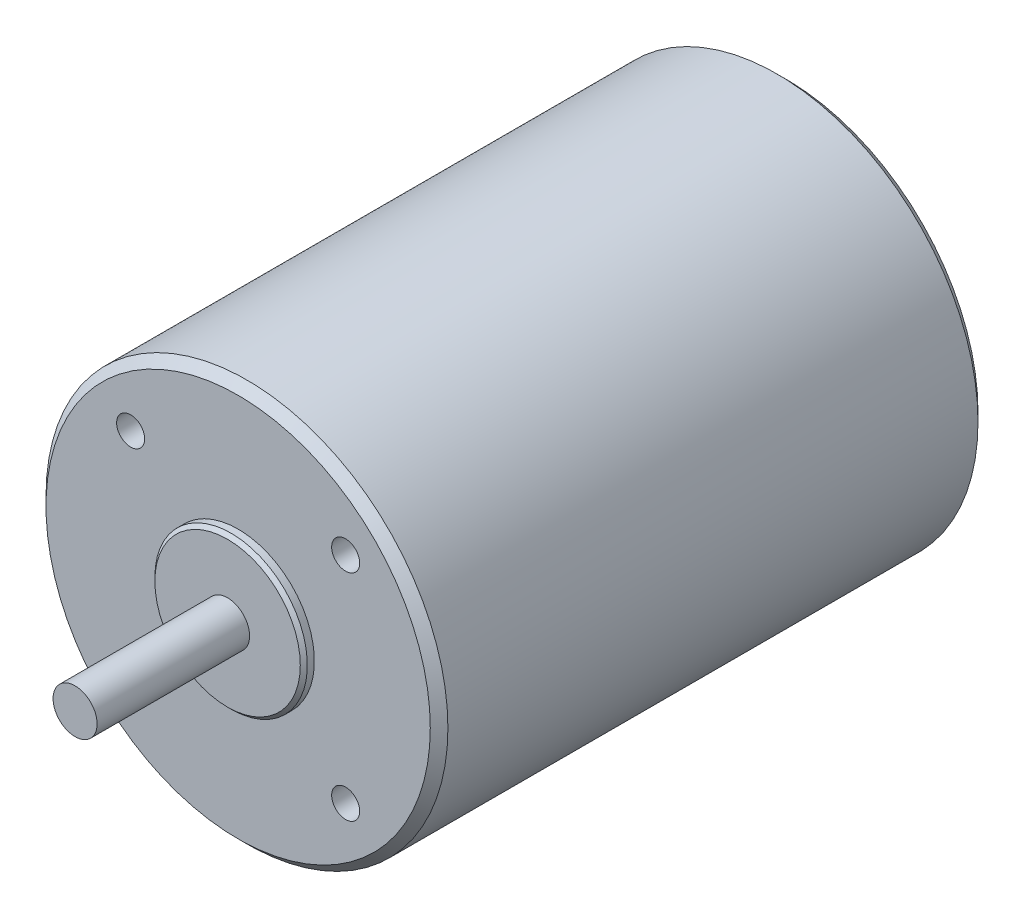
ISO-10303-21;
HEADER;
FILE_DESCRIPTION(('STEP AP214'),'2;1');
FILE_NAME('part.step','',(''),(''),'','','');
FILE_SCHEMA(('AUTOMOTIVE_DESIGN { 1 0 10303 214 1 1 1 1 }'));
ENDSEC;
DATA;
#1=APPLICATION_CONTEXT('core data for automotive mechanical design processes');
#2=APPLICATION_PROTOCOL_DEFINITION('international standard','automotive_design',2000,#1);
#3=PRODUCT_CONTEXT('',#1,'mechanical');
#4=PRODUCT('Part','Part','',(#3));
#5=PRODUCT_RELATED_PRODUCT_CATEGORY('part','',(#4));
#6=PRODUCT_DEFINITION_FORMATION('','',#4);
#7=PRODUCT_DEFINITION_CONTEXT('part definition',#1,'design');
#8=PRODUCT_DEFINITION('design','',#6,#7);
#9=PRODUCT_DEFINITION_SHAPE('','',#8);
#10=(LENGTH_UNIT() NAMED_UNIT(*) SI_UNIT(.MILLI.,.METRE.));
#11=(NAMED_UNIT(*) PLANE_ANGLE_UNIT() SI_UNIT($,.RADIAN.));
#12=(NAMED_UNIT(*) SI_UNIT($,.STERADIAN.) SOLID_ANGLE_UNIT());
#13=UNCERTAINTY_MEASURE_WITH_UNIT(LENGTH_MEASURE(1.E-05),#10,'distance_accuracy_value','');
#14=(GEOMETRIC_REPRESENTATION_CONTEXT(3) GLOBAL_UNCERTAINTY_ASSIGNED_CONTEXT((#13)) GLOBAL_UNIT_ASSIGNED_CONTEXT((#10,
#11,#12)) REPRESENTATION_CONTEXT('',''));
#15=CARTESIAN_POINT('',(0.,0.,0.));
#16=DIRECTION('',(0.,0.,1.));
#17=DIRECTION('',(1.,0.,0.));
#18=AXIS2_PLACEMENT_3D('',#15,#16,#17);
#19=CARTESIAN_POINT('',(0.,0.,78.9178));
#20=DIRECTION('',(0.,0.,1.));
#21=DIRECTION('',(1.,0.,0.));
#22=AXIS2_PLACEMENT_3D('',#19,#20,#21);
#23=PLANE('',#22);
#24=CARTESIAN_POINT('',(15.4909418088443,15.4909418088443,78.9178));
#25=DIRECTION('',(0.,0.,1.));
#26=DIRECTION('',(1.,0.,0.));
#27=AXIS2_PLACEMENT_3D('',#24,#25,#26);
#28=CIRCLE('',#27,2.0193);
#29=CARTESIAN_POINT('',(17.5102418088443,15.4909418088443,78.9178));
#30=VERTEX_POINT('',#29);
#31=EDGE_CURVE('E72',#30,#30,#28,.T.);
#32=ORIENTED_EDGE('',*,*,#31,.F.);
#33=EDGE_LOOP('',(#32));
#34=FACE_BOUND('',#33,.T.);
#35=CARTESIAN_POINT('',(15.4909418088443,-15.4909418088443,78.9178));
#36=DIRECTION('',(0.,0.,1.));
#37=DIRECTION('',(1.,0.,0.));
#38=AXIS2_PLACEMENT_3D('',#35,#36,#37);
#39=CIRCLE('',#38,2.0193);
#40=CARTESIAN_POINT('',(17.5102418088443,-15.4909418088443,78.9178));
#41=VERTEX_POINT('',#40);
#42=EDGE_CURVE('E80',#41,#41,#39,.T.);
#43=ORIENTED_EDGE('',*,*,#42,.F.);
#44=EDGE_LOOP('',(#43));
#45=FACE_BOUND('',#44,.T.);
#46=CARTESIAN_POINT('',(-15.4909418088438,-15.4909418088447,78.9178));
#47=DIRECTION('',(0.,0.,1.));
#48=DIRECTION('',(1.,0.,0.));
#49=AXIS2_PLACEMENT_3D('',#46,#47,#48);
#50=CIRCLE('',#49,2.0193);
#51=CARTESIAN_POINT('',(-13.4716418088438,-15.4909418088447,78.9178));
#52=VERTEX_POINT('',#51);
#53=EDGE_CURVE('E86',#52,#52,#50,.T.);
#54=ORIENTED_EDGE('',*,*,#53,.F.);
#55=EDGE_LOOP('',(#54));
#56=FACE_BOUND('',#55,.T.);
#57=CARTESIAN_POINT('',(-15.4909418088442,15.4909418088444,78.9178));
#58=DIRECTION('',(0.,0.,1.));
#59=DIRECTION('',(1.,0.,0.));
#60=AXIS2_PLACEMENT_3D('',#57,#58,#59);
#61=CIRCLE('',#60,2.0193);
#62=CARTESIAN_POINT('',(-13.4716418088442,15.4909418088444,78.9178));
#63=VERTEX_POINT('',#62);
#64=EDGE_CURVE('E92',#63,#63,#61,.T.);
#65=ORIENTED_EDGE('',*,*,#64,.F.);
#66=EDGE_LOOP('',(#65));
#67=FACE_BOUND('',#66,.T.);
#68=CARTESIAN_POINT('',(0.,0.,78.9178));
#69=DIRECTION('',(0.,0.,1.));
#70=DIRECTION('',(1.,0.,0.));
#71=AXIS2_PLACEMENT_3D('',#68,#69,#70);
#72=CIRCLE('',#71,27.686);
#73=CARTESIAN_POINT('',(27.686,0.,78.9178));
#74=VERTEX_POINT('',#73);
#75=EDGE_CURVE('E11',#74,#74,#72,.T.);
#76=ORIENTED_EDGE('',*,*,#75,.T.);
#77=EDGE_LOOP('',(#76));
#78=FACE_BOUND('',#77,.T.);
#79=CARTESIAN_POINT('',(0.,0.,78.9178));
#80=DIRECTION('',(0.,0.,1.));
#81=DIRECTION('',(1.,0.,0.));
#82=AXIS2_PLACEMENT_3D('',#79,#80,#81);
#83=CIRCLE('',#82,10.9855);
#84=CARTESIAN_POINT('',(-10.9855,0.,78.9178));
#85=VERTEX_POINT('',#84);
#86=EDGE_CURVE('E95',#85,#85,#83,.T.);
#87=ORIENTED_EDGE('',*,*,#86,.F.);
#88=EDGE_LOOP('',(#87));
#89=FACE_BOUND('',#88,.T.);
#90=ADVANCED_FACE('F42',(#34,#45,#56,#67,#78,#89),#23,.T.);
#91=CARTESIAN_POINT('',(0.,0.,78.9178));
#92=DIRECTION('',(0.,0.,-1.));
#93=DIRECTION('',(-1.,0.,0.));
#94=AXIS2_PLACEMENT_3D('',#91,#92,#93);
#95=CYLINDRICAL_SURFACE('',#94,28.956);
#96=CARTESIAN_POINT('',(0.,0.,1.27000000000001));
#97=DIRECTION('',(0.,0.,1.));
#98=DIRECTION('',(1.,0.,0.));
#99=AXIS2_PLACEMENT_3D('',#96,#97,#98);
#100=CIRCLE('',#99,28.956);
#101=CARTESIAN_POINT('',(28.956,0.,1.27000000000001));
#102=VERTEX_POINT('',#101);
#103=EDGE_CURVE('E113',#102,#102,#100,.T.);
#104=ORIENTED_EDGE('',*,*,#103,.T.);
#105=EDGE_LOOP('',(#104));
#106=FACE_BOUND('',#105,.T.);
#107=CARTESIAN_POINT('',(0.,0.,77.6478));
#108=DIRECTION('',(0.,0.,1.));
#109=DIRECTION('',(1.,0.,0.));
#110=AXIS2_PLACEMENT_3D('',#107,#108,#109);
#111=CIRCLE('',#110,28.956);
#112=CARTESIAN_POINT('',(28.956,0.,77.6478));
#113=VERTEX_POINT('',#112);
#114=EDGE_CURVE('E110',#113,#113,#111,.F.);
#115=ORIENTED_EDGE('',*,*,#114,.T.);
#116=EDGE_LOOP('',(#115));
#117=FACE_BOUND('',#116,.T.);
#118=ADVANCED_FACE('F44',(#106,#117),#95,.T.);
#119=CARTESIAN_POINT('',(0.,0.,0.));
#120=DIRECTION('',(0.,0.,1.));
#121=DIRECTION('',(1.,0.,0.));
#122=AXIS2_PLACEMENT_3D('',#119,#120,#121);
#123=PLANE('',#122);
#124=CARTESIAN_POINT('',(0.,0.,0.));
#125=DIRECTION('',(0.,0.,1.));
#126=DIRECTION('',(1.,0.,0.));
#127=AXIS2_PLACEMENT_3D('',#124,#125,#126);
#128=CIRCLE('',#127,27.686);
#129=CARTESIAN_POINT('',(27.686,0.,0.));
#130=VERTEX_POINT('',#129);
#131=EDGE_CURVE('E50',#130,#130,#128,.F.);
#132=ORIENTED_EDGE('',*,*,#131,.T.);
#133=EDGE_LOOP('',(#132));
#134=FACE_BOUND('',#133,.T.);
#135=ADVANCED_FACE('F118',(#134),#123,.F.);
#136=CARTESIAN_POINT('',(0.,0.,80.4418));
#137=DIRECTION('',(0.,0.,1.));
#138=DIRECTION('',(1.,0.,0.));
#139=AXIS2_PLACEMENT_3D('',#136,#137,#138);
#140=PLANE('',#139);
#141=CARTESIAN_POINT('',(0.,0.,80.4418));
#142=DIRECTION('',(0.,0.,1.));
#143=DIRECTION('',(1.,0.,0.));
#144=AXIS2_PLACEMENT_3D('',#141,#142,#143);
#145=CIRCLE('',#144,10.4775);
#146=CARTESIAN_POINT('',(10.4775,0.,80.4418));
#147=VERTEX_POINT('',#146);
#148=EDGE_CURVE('E102',#147,#147,#145,.T.);
#149=ORIENTED_EDGE('',*,*,#148,.T.);
#150=EDGE_LOOP('',(#149));
#151=FACE_BOUND('',#150,.T.);
#152=CARTESIAN_POINT('',(0.,0.,80.4418));
#153=DIRECTION('',(0.,0.,1.));
#154=DIRECTION('',(1.,0.,0.));
#155=AXIS2_PLACEMENT_3D('',#152,#153,#154);
#156=CIRCLE('',#155,3.175);
#157=CARTESIAN_POINT('',(3.175,0.,80.4418));
#158=VERTEX_POINT('',#157);
#159=EDGE_CURVE('E98',#158,#158,#156,.T.);
#160=ORIENTED_EDGE('',*,*,#159,.F.);
#161=EDGE_LOOP('',(#160));
#162=FACE_BOUND('',#161,.T.);
#163=ADVANCED_FACE('F146',(#151,#162),#140,.T.);
#164=CARTESIAN_POINT('',(0.,0.,80.4418));
#165=DIRECTION('',(0.,0.,-1.));
#166=DIRECTION('',(-1.,0.,0.));
#167=AXIS2_PLACEMENT_3D('',#164,#165,#166);
#168=CYLINDRICAL_SURFACE('',#167,10.9855);
#169=CARTESIAN_POINT('',(0.,0.,79.9338));
#170=DIRECTION('',(0.,0.,1.));
#171=DIRECTION('',(1.,0.,0.));
#172=AXIS2_PLACEMENT_3D('',#169,#170,#171);
#173=CIRCLE('',#172,10.9855);
#174=CARTESIAN_POINT('',(-10.9855,0.,79.9338));
#175=VERTEX_POINT('',#174);
#176=EDGE_CURVE('E107',#175,#175,#173,.F.);
#177=CARTESIAN_POINT('',(-10.9855,0.,79.9338));
#178=CARTESIAN_POINT('',(-10.9855,0.,79.9232166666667));
#179=CARTESIAN_POINT('',(-10.9855,0.,79.9126333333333));
#180=CARTESIAN_POINT('',(-10.9855,0.,79.8914666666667));
#181=CARTESIAN_POINT('',(-10.9855,0.,79.8808833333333));
#182=CARTESIAN_POINT('',(-10.9855,0.,79.8597166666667));
#183=CARTESIAN_POINT('',(-10.9855,0.,79.8491333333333));
#184=CARTESIAN_POINT('',(-10.9855,0.,79.8279666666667));
#185=CARTESIAN_POINT('',(-10.9855,0.,79.8173833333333));
#186=CARTESIAN_POINT('',(-10.9855,0.,79.7962166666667));
#187=CARTESIAN_POINT('',(-10.9855,0.,79.7856333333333));
#188=CARTESIAN_POINT('',(-10.9855,0.,79.7644666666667));
#189=CARTESIAN_POINT('',(-10.9855,0.,79.7538833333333));
#190=CARTESIAN_POINT('',(-10.9855,0.,79.7327166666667));
#191=CARTESIAN_POINT('',(-10.9855,0.,79.7221333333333));
#192=CARTESIAN_POINT('',(-10.9855,0.,79.7009666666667));
#193=CARTESIAN_POINT('',(-10.9855,0.,79.6903833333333));
#194=CARTESIAN_POINT('',(-10.9855,0.,79.6692166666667));
#195=CARTESIAN_POINT('',(-10.9855,0.,79.6586333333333));
#196=CARTESIAN_POINT('',(-10.9855,0.,79.6374666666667));
#197=CARTESIAN_POINT('',(-10.9855,0.,79.6268833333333));
#198=CARTESIAN_POINT('',(-10.9855,0.,79.6057166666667));
#199=CARTESIAN_POINT('',(-10.9855,0.,79.5951333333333));
#200=CARTESIAN_POINT('',(-10.9855,0.,79.5739666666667));
#201=CARTESIAN_POINT('',(-10.9855,0.,79.5633833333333));
#202=CARTESIAN_POINT('',(-10.9855,0.,79.5422166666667));
#203=CARTESIAN_POINT('',(-10.9855,0.,79.5316333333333));
#204=CARTESIAN_POINT('',(-10.9855,0.,79.5104666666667));
#205=CARTESIAN_POINT('',(-10.9855,0.,79.4998833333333));
#206=CARTESIAN_POINT('',(-10.9855,0.,79.4787166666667));
#207=CARTESIAN_POINT('',(-10.9855,0.,79.4681333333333));
#208=CARTESIAN_POINT('',(-10.9855,0.,79.4469666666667));
#209=CARTESIAN_POINT('',(-10.9855,0.,79.4363833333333));
#210=CARTESIAN_POINT('',(-10.9855,0.,79.4152166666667));
#211=CARTESIAN_POINT('',(-10.9855,0.,79.4046333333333));
#212=CARTESIAN_POINT('',(-10.9855,0.,79.3834666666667));
#213=CARTESIAN_POINT('',(-10.9855,0.,79.3728833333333));
#214=CARTESIAN_POINT('',(-10.9855,0.,79.3517166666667));
#215=CARTESIAN_POINT('',(-10.9855,0.,79.3411333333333));
#216=CARTESIAN_POINT('',(-10.9855,0.,79.3199666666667));
#217=CARTESIAN_POINT('',(-10.9855,0.,79.3093833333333));
#218=CARTESIAN_POINT('',(-10.9855,0.,79.2882166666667));
#219=CARTESIAN_POINT('',(-10.9855,0.,79.2776333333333));
#220=CARTESIAN_POINT('',(-10.9855,0.,79.2564666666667));
#221=CARTESIAN_POINT('',(-10.9855,0.,79.2458833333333));
#222=CARTESIAN_POINT('',(-10.9855,0.,79.2247166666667));
#223=CARTESIAN_POINT('',(-10.9855,0.,79.2141333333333));
#224=CARTESIAN_POINT('',(-10.9855,0.,79.1929666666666));
#225=CARTESIAN_POINT('',(-10.9855,0.,79.1823833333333));
#226=CARTESIAN_POINT('',(-10.9855,0.,79.1612166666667));
#227=CARTESIAN_POINT('',(-10.9855,0.,79.1506333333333));
#228=CARTESIAN_POINT('',(-10.9855,0.,79.1294666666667));
#229=CARTESIAN_POINT('',(-10.9855,0.,79.1188833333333));
#230=CARTESIAN_POINT('',(-10.9855,0.,79.0977166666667));
#231=CARTESIAN_POINT('',(-10.9855,0.,79.0871333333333));
#232=CARTESIAN_POINT('',(-10.9855,0.,79.0659666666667));
#233=CARTESIAN_POINT('',(-10.9855,0.,79.0553833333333));
#234=CARTESIAN_POINT('',(-10.9855,0.,79.0342166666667));
#235=CARTESIAN_POINT('',(-10.9855,0.,79.0236333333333));
#236=CARTESIAN_POINT('',(-10.9855,0.,79.0024666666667));
#237=CARTESIAN_POINT('',(-10.9855,0.,78.9918833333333));
#238=CARTESIAN_POINT('',(-10.9855,0.,78.9707166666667));
#239=CARTESIAN_POINT('',(-10.9855,0.,78.9601333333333));
#240=CARTESIAN_POINT('',(-10.9855,0.,78.9389666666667));
#241=CARTESIAN_POINT('',(-10.9855,0.,78.9283833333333));
#242=CARTESIAN_POINT('',(-10.9855,0.,78.9178));
#243=B_SPLINE_CURVE_WITH_KNOTS('',3,(#177,#178,#179,#180,#181,#182,#183,#184,#185,#186,#187,
#188,#189,#190,#191,#192,#193,#194,#195,#196,#197,#198,#199,#200,#201,#202,#203,#204,#205,#206,
#207,#208,#209,#210,#211,#212,#213,#214,#215,#216,#217,#218,#219,#220,#221,#222,#223,#224,#225,
#226,#227,#228,#229,#230,#231,#232,#233,#234,#235,#236,#237,#238,#239,#240,#241,#242),
.UNSPECIFIED.,.F.,.F.,(4,2,2,2,2,2,2,2,2,2,2,2,2,2,2,2,2,2,2,2,2,2,2,2,2,2,2,2,2,2,2,2,4),(0.,
0.0317499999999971,0.0634999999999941,0.0952499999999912,0.126999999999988,0.158749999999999,
0.190499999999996,0.222249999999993,0.25399999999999,0.285749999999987,0.317499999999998,
0.349249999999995,0.380999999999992,0.41274999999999,0.4445,0.476249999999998,0.507999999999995,
0.539749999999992,0.571499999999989,0.60325,0.634999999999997,0.666749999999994,
0.698499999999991,0.730250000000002,0.761999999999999,0.793749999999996,0.825499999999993,
0.85724999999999,0.889000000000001,0.920749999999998,0.952499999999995,0.984249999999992,
1.01599999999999),.UNSPECIFIED.);
#244=EDGE_CURVE('BSEAM143',#175,#85,#243,.T.);
#245=ORIENTED_EDGE('',*,*,#176,.T.);
#246=ORIENTED_EDGE('',*,*,#86,.T.);
#247=ORIENTED_EDGE('',*,*,#244,.T.);
#248=ORIENTED_EDGE('',*,*,#244,.F.);
#249=EDGE_LOOP('',(#245,#247,#246,#248));
#250=FACE_BOUND('',#249,.T.);
#251=ADVANCED_FACE('F143',(#250),#168,.T.);
#252=CARTESIAN_POINT('',(0.,0.,102.4128));
#253=DIRECTION('',(0.,0.,1.));
#254=DIRECTION('',(1.,0.,0.));
#255=AXIS2_PLACEMENT_3D('',#252,#253,#254);
#256=PLANE('',#255);
#257=CARTESIAN_POINT('',(0.,0.,102.4128));
#258=DIRECTION('',(0.,0.,1.));
#259=DIRECTION('',(1.,0.,0.));
#260=AXIS2_PLACEMENT_3D('',#257,#258,#259);
#261=CIRCLE('',#260,3.175);
#262=CARTESIAN_POINT('',(3.175,0.,102.4128));
#263=VERTEX_POINT('',#262);
#264=EDGE_CURVE('E99',#263,#263,#261,.T.);
#265=ORIENTED_EDGE('',*,*,#264,.T.);
#266=EDGE_LOOP('',(#265));
#267=FACE_BOUND('',#266,.T.);
#268=ADVANCED_FACE('F145',(#267),#256,.T.);
#269=CARTESIAN_POINT('',(0.,0.,102.4128));
#270=DIRECTION('',(0.,0.,-1.));
#271=DIRECTION('',(-1.,0.,0.));
#272=AXIS2_PLACEMENT_3D('',#269,#270,#271);
#273=CYLINDRICAL_SURFACE('',#272,3.175);
#274=ORIENTED_EDGE('',*,*,#159,.T.);
#275=EDGE_LOOP('',(#274));
#276=FACE_BOUND('',#275,.T.);
#277=ORIENTED_EDGE('',*,*,#264,.F.);
#278=EDGE_LOOP('',(#277));
#279=FACE_BOUND('',#278,.T.);
#280=ADVANCED_FACE('F153',(#276,#279),#273,.T.);
#281=CARTESIAN_POINT('',(0.,0.,80.4418));
#282=DIRECTION('',(0.,0.,-1.));
#283=DIRECTION('',(-1.,0.,0.));
#284=AXIS2_PLACEMENT_3D('',#281,#282,#283);
#285=CONICAL_SURFACE('',#284,10.4775,0.785398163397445);
#286=ORIENTED_EDGE('',*,*,#176,.F.);
#287=EDGE_LOOP('',(#286));
#288=FACE_BOUND('',#287,.T.);
#289=ORIENTED_EDGE('',*,*,#148,.F.);
#290=EDGE_LOOP('',(#289));
#291=FACE_BOUND('',#290,.T.);
#292=ADVANCED_FACE('F124',(#288,#291),#285,.T.);
#293=CARTESIAN_POINT('',(0.,0.,1.27000000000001));
#294=DIRECTION('',(0.,0.,1.));
#295=DIRECTION('',(1.,0.,0.));
#296=AXIS2_PLACEMENT_3D('',#293,#294,#295);
#297=CONICAL_SURFACE('',#296,28.956,0.785398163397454);
#298=ORIENTED_EDGE('',*,*,#131,.F.);
#299=EDGE_LOOP('',(#298));
#300=FACE_BOUND('',#299,.T.);
#301=ORIENTED_EDGE('',*,*,#103,.F.);
#302=EDGE_LOOP('',(#301));
#303=FACE_BOUND('',#302,.T.);
#304=ADVANCED_FACE('F120',(#300,#303),#297,.T.);
#305=CARTESIAN_POINT('',(0.,0.,78.9178));
#306=DIRECTION('',(0.,0.,-1.));
#307=DIRECTION('',(-1.,0.,0.));
#308=AXIS2_PLACEMENT_3D('',#305,#306,#307);
#309=CONICAL_SURFACE('',#308,27.686,0.785398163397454);
#310=ORIENTED_EDGE('',*,*,#114,.F.);
#311=EDGE_LOOP('',(#310));
#312=FACE_BOUND('',#311,.T.);
#313=ORIENTED_EDGE('',*,*,#75,.F.);
#314=EDGE_LOOP('',(#313));
#315=FACE_BOUND('',#314,.T.);
#316=ADVANCED_FACE('F123',(#312,#315),#309,.T.);
#317=CARTESIAN_POINT('',(-15.4909418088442,15.4909418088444,78.9178));
#318=DIRECTION('',(0.,0.,1.));
#319=DIRECTION('',(1.,0.,0.));
#320=AXIS2_PLACEMENT_3D('',#317,#318,#319);
#321=CYLINDRICAL_SURFACE('',#320,2.0193);
#322=CARTESIAN_POINT('',(-15.4909418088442,15.4909418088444,65.3034));
#323=DIRECTION('',(0.,0.,1.));
#324=DIRECTION('',(1.,0.,0.));
#325=AXIS2_PLACEMENT_3D('',#322,#323,#324);
#326=CIRCLE('',#325,2.0193);
#327=CARTESIAN_POINT('',(-13.4716418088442,15.4909418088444,65.3034));
#328=VERTEX_POINT('',#327);
#329=EDGE_CURVE('E89',#328,#328,#326,.T.);
#330=ORIENTED_EDGE('',*,*,#329,.F.);
#331=EDGE_LOOP('',(#330));
#332=FACE_BOUND('',#331,.T.);
#333=ORIENTED_EDGE('',*,*,#64,.T.);
#334=EDGE_LOOP('',(#333));
#335=FACE_BOUND('',#334,.T.);
#336=ADVANCED_FACE('F134',(#332,#335),#321,.F.);
#337=CARTESIAN_POINT('',(-15.4909418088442,15.4909418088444,65.3034));
#338=DIRECTION('',(0.,0.,1.));
#339=DIRECTION('',(1.,0.,0.));
#340=AXIS2_PLACEMENT_3D('',#337,#338,#339);
#341=CONICAL_SURFACE('',#340,2.0193,1.02974425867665);
#342=CARTESIAN_POINT('',(-15.4909418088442,15.4909418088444,64.0900821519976));
#343=VERTEX_POINT('',#342);
#344=VERTEX_LOOP('',#343);
#345=FACE_BOUND('',#344,.T.);
#346=ORIENTED_EDGE('',*,*,#329,.T.);
#347=EDGE_LOOP('',(#346));
#348=FACE_BOUND('',#347,.T.);
#349=ADVANCED_FACE('F223',(#345,#348),#341,.F.);
#350=CARTESIAN_POINT('',(-15.4909418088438,-15.4909418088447,78.9178));
#351=DIRECTION('',(0.,0.,1.));
#352=DIRECTION('',(1.,0.,0.));
#353=AXIS2_PLACEMENT_3D('',#350,#351,#352);
#354=CYLINDRICAL_SURFACE('',#353,2.0193);
#355=CARTESIAN_POINT('',(-15.4909418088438,-15.4909418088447,65.3034));
#356=DIRECTION('',(0.,0.,1.));
#357=DIRECTION('',(1.,0.,0.));
#358=AXIS2_PLACEMENT_3D('',#355,#356,#357);
#359=CIRCLE('',#358,2.0193);
#360=CARTESIAN_POINT('',(-13.4716418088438,-15.4909418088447,65.3034));
#361=VERTEX_POINT('',#360);
#362=EDGE_CURVE('E83',#361,#361,#359,.T.);
#363=ORIENTED_EDGE('',*,*,#362,.F.);
#364=EDGE_LOOP('',(#363));
#365=FACE_BOUND('',#364,.T.);
#366=ORIENTED_EDGE('',*,*,#53,.T.);
#367=EDGE_LOOP('',(#366));
#368=FACE_BOUND('',#367,.T.);
#369=ADVANCED_FACE('F235',(#365,#368),#354,.F.);
#370=CARTESIAN_POINT('',(-15.4909418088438,-15.4909418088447,65.3034));
#371=DIRECTION('',(0.,0.,1.));
#372=DIRECTION('',(1.,0.,0.));
#373=AXIS2_PLACEMENT_3D('',#370,#371,#372);
#374=CONICAL_SURFACE('',#373,2.0193,1.02974425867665);
#375=CARTESIAN_POINT('',(-15.4909418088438,-15.4909418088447,64.0900821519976));
#376=VERTEX_POINT('',#375);
#377=VERTEX_LOOP('',#376);
#378=FACE_BOUND('',#377,.T.);
#379=ORIENTED_EDGE('',*,*,#362,.T.);
#380=EDGE_LOOP('',(#379));
#381=FACE_BOUND('',#380,.T.);
#382=ADVANCED_FACE('F244',(#378,#381),#374,.F.);
#383=CARTESIAN_POINT('',(15.4909418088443,-15.4909418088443,78.9178));
#384=DIRECTION('',(0.,0.,1.));
#385=DIRECTION('',(1.,0.,0.));
#386=AXIS2_PLACEMENT_3D('',#383,#384,#385);
#387=CYLINDRICAL_SURFACE('',#386,2.0193);
#388=CARTESIAN_POINT('',(15.4909418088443,-15.4909418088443,65.3034));
#389=DIRECTION('',(0.,0.,1.));
#390=DIRECTION('',(1.,0.,0.));
#391=AXIS2_PLACEMENT_3D('',#388,#389,#390);
#392=CIRCLE('',#391,2.0193);
#393=CARTESIAN_POINT('',(17.5102418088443,-15.4909418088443,65.3034));
#394=VERTEX_POINT('',#393);
#395=EDGE_CURVE('E75',#394,#394,#392,.T.);
#396=ORIENTED_EDGE('',*,*,#395,.F.);
#397=EDGE_LOOP('',(#396));
#398=FACE_BOUND('',#397,.T.);
#399=ORIENTED_EDGE('',*,*,#42,.T.);
#400=EDGE_LOOP('',(#399));
#401=FACE_BOUND('',#400,.T.);
#402=ADVANCED_FACE('F256',(#398,#401),#387,.F.);
#403=CARTESIAN_POINT('',(15.4909418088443,-15.4909418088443,65.3034));
#404=DIRECTION('',(0.,0.,1.));
#405=DIRECTION('',(1.,0.,0.));
#406=AXIS2_PLACEMENT_3D('',#403,#404,#405);
#407=CONICAL_SURFACE('',#406,2.0193,1.02974425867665);
#408=CARTESIAN_POINT('',(15.4909418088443,-15.4909418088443,64.0900821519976));
#409=VERTEX_POINT('',#408);
#410=VERTEX_LOOP('',#409);
#411=FACE_BOUND('',#410,.T.);
#412=ORIENTED_EDGE('',*,*,#395,.T.);
#413=EDGE_LOOP('',(#412));
#414=FACE_BOUND('',#413,.T.);
#415=ADVANCED_FACE('F265',(#411,#414),#407,.F.);
#416=CARTESIAN_POINT('',(15.4909418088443,15.4909418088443,78.9178));
#417=DIRECTION('',(0.,0.,1.));
#418=DIRECTION('',(1.,0.,0.));
#419=AXIS2_PLACEMENT_3D('',#416,#417,#418);
#420=CYLINDRICAL_SURFACE('',#419,2.0193);
#421=CARTESIAN_POINT('',(15.4909418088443,15.4909418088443,65.3034));
#422=DIRECTION('',(0.,0.,1.));
#423=DIRECTION('',(1.,0.,0.));
#424=AXIS2_PLACEMENT_3D('',#421,#422,#423);
#425=CIRCLE('',#424,2.0193);
#426=CARTESIAN_POINT('',(17.5102418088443,15.4909418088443,65.3034));
#427=VERTEX_POINT('',#426);
#428=EDGE_CURVE('E70',#427,#427,#425,.T.);
#429=ORIENTED_EDGE('',*,*,#428,.F.);
#430=EDGE_LOOP('',(#429));
#431=FACE_BOUND('',#430,.T.);
#432=ORIENTED_EDGE('',*,*,#31,.T.);
#433=EDGE_LOOP('',(#432));
#434=FACE_BOUND('',#433,.T.);
#435=ADVANCED_FACE('F66',(#431,#434),#420,.F.);
#436=CARTESIAN_POINT('',(15.4909418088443,15.4909418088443,65.3034));
#437=DIRECTION('',(0.,0.,1.));
#438=DIRECTION('',(1.,0.,0.));
#439=AXIS2_PLACEMENT_3D('',#436,#437,#438);
#440=CONICAL_SURFACE('',#439,2.0193,1.02974425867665);
#441=CARTESIAN_POINT('',(15.4909418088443,15.4909418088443,64.0900821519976));
#442=VERTEX_POINT('',#441);
#443=VERTEX_LOOP('',#442);
#444=FACE_BOUND('',#443,.T.);
#445=ORIENTED_EDGE('',*,*,#428,.T.);
#446=EDGE_LOOP('',(#445));
#447=FACE_BOUND('',#446,.T.);
#448=ADVANCED_FACE('F63',(#444,#447),#440,.F.);
#449=CLOSED_SHELL('',(#90,#118,#135,#163,#251,#268,#280,#292,#304,#316,#336,#349,#369,#382,#402,
#415,#435,#448));
#450=MANIFOLD_SOLID_BREP('B2',#449);
#451=ADVANCED_BREP_SHAPE_REPRESENTATION('',(#18,#450),#14);
#452=SHAPE_DEFINITION_REPRESENTATION(#9,#451);
ENDSEC;
END-ISO-10303-21;
